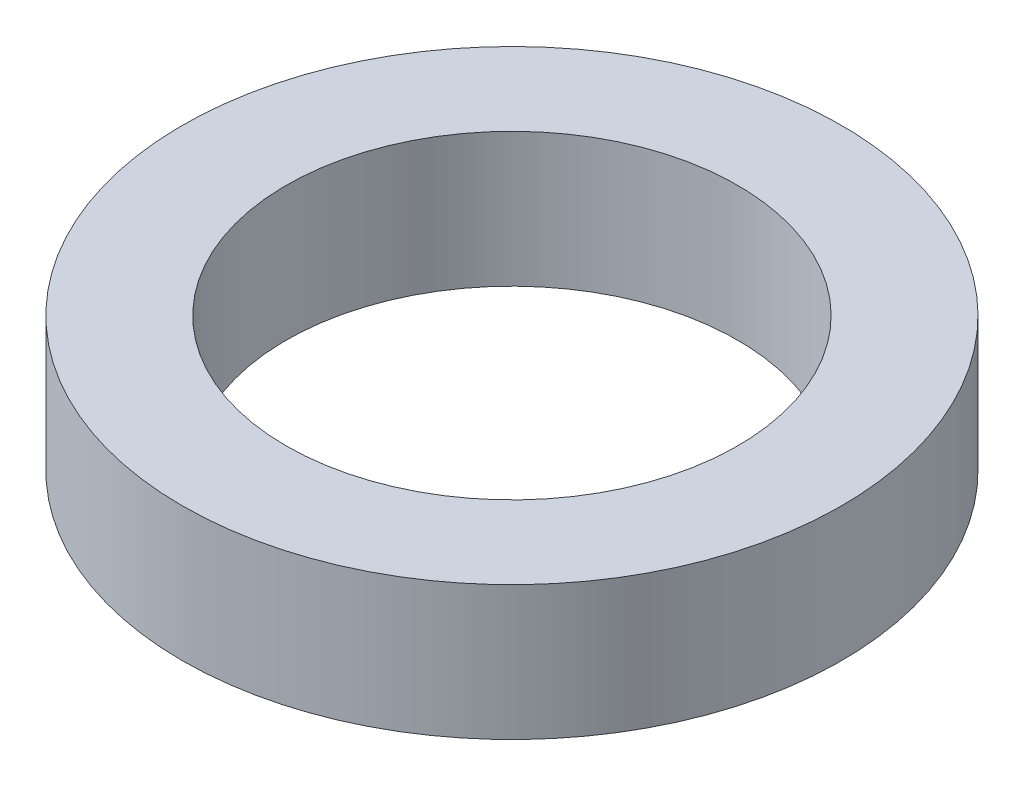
ISO-10303-21;
HEADER;
FILE_DESCRIPTION(('STEP AP214'),'2;1');
FILE_NAME('part.step','',(''),(''),'','','');
FILE_SCHEMA(('AUTOMOTIVE_DESIGN { 1 0 10303 214 1 1 1 1 }'));
ENDSEC;
DATA;
#1=APPLICATION_CONTEXT('core data for automotive mechanical design processes');
#2=APPLICATION_PROTOCOL_DEFINITION('international standard','automotive_design',2000,#1);
#3=PRODUCT_CONTEXT('',#1,'mechanical');
#4=PRODUCT('Part','Part','',(#3));
#5=PRODUCT_RELATED_PRODUCT_CATEGORY('part','',(#4));
#6=PRODUCT_DEFINITION_FORMATION('','',#4);
#7=PRODUCT_DEFINITION_CONTEXT('part definition',#1,'design');
#8=PRODUCT_DEFINITION('design','',#6,#7);
#9=PRODUCT_DEFINITION_SHAPE('','',#8);
#10=(LENGTH_UNIT() NAMED_UNIT(*) SI_UNIT(.MILLI.,.METRE.));
#11=(NAMED_UNIT(*) PLANE_ANGLE_UNIT() SI_UNIT($,.RADIAN.));
#12=(NAMED_UNIT(*) SI_UNIT($,.STERADIAN.) SOLID_ANGLE_UNIT());
#13=UNCERTAINTY_MEASURE_WITH_UNIT(LENGTH_MEASURE(1.E-05),#10,'distance_accuracy_value','');
#14=(GEOMETRIC_REPRESENTATION_CONTEXT(3) GLOBAL_UNCERTAINTY_ASSIGNED_CONTEXT((#13)) GLOBAL_UNIT_ASSIGNED_CONTEXT((#10,
#11,#12)) REPRESENTATION_CONTEXT('',''));
#15=CARTESIAN_POINT('',(0.,0.,0.));
#16=DIRECTION('',(0.,0.,1.));
#17=DIRECTION('',(1.,0.,0.));
#18=AXIS2_PLACEMENT_3D('',#15,#16,#17);
#19=CARTESIAN_POINT('',(0.,2.3622,0.));
#20=DIRECTION('',(0.,1.,0.));
#21=DIRECTION('',(0.,0.,1.));
#22=AXIS2_PLACEMENT_3D('',#19,#20,#21);
#23=PLANE('',#22);
#24=CARTESIAN_POINT('',(0.,2.3622,0.));
#25=DIRECTION('',(0.,1.,0.));
#26=DIRECTION('',(0.,0.,1.));
#27=AXIS2_PLACEMENT_3D('',#24,#25,#26);
#28=CIRCLE('',#27,5.8039);
#29=CARTESIAN_POINT('',(0.,2.3622,5.8039));
#30=VERTEX_POINT('',#29);
#31=EDGE_CURVE('E10',#30,#30,#28,.T.);
#32=ORIENTED_EDGE('',*,*,#31,.T.);
#33=EDGE_LOOP('',(#32));
#34=FACE_BOUND('',#33,.T.);
#35=CARTESIAN_POINT('',(0.,2.3622,0.));
#36=DIRECTION('',(0.,1.,0.));
#37=DIRECTION('',(0.,0.,1.));
#38=AXIS2_PLACEMENT_3D('',#35,#36,#37);
#39=CIRCLE('',#38,3.9751);
#40=CARTESIAN_POINT('',(0.,2.3622,3.9751));
#41=VERTEX_POINT('',#40);
#42=EDGE_CURVE('E41',#41,#41,#39,.T.);
#43=ORIENTED_EDGE('',*,*,#42,.F.);
#44=EDGE_LOOP('',(#43));
#45=FACE_BOUND('',#44,.T.);
#46=ADVANCED_FACE('F30',(#34,#45),#23,.T.);
#47=CARTESIAN_POINT('',(0.,0.,0.));
#48=DIRECTION('',(0.,1.,0.));
#49=DIRECTION('',(0.,0.,1.));
#50=AXIS2_PLACEMENT_3D('',#47,#48,#49);
#51=PLANE('',#50);
#52=CARTESIAN_POINT('',(0.,0.,0.));
#53=DIRECTION('',(0.,1.,0.));
#54=DIRECTION('',(0.,0.,1.));
#55=AXIS2_PLACEMENT_3D('',#52,#53,#54);
#56=CIRCLE('',#55,5.8039);
#57=CARTESIAN_POINT('',(0.,0.,5.8039));
#58=VERTEX_POINT('',#57);
#59=EDGE_CURVE('E34',#58,#58,#56,.T.);
#60=ORIENTED_EDGE('',*,*,#59,.F.);
#61=EDGE_LOOP('',(#60));
#62=FACE_BOUND('',#61,.T.);
#63=CARTESIAN_POINT('',(0.,0.,0.));
#64=DIRECTION('',(0.,1.,0.));
#65=DIRECTION('',(0.,0.,1.));
#66=AXIS2_PLACEMENT_3D('',#63,#64,#65);
#67=CIRCLE('',#66,3.9751);
#68=CARTESIAN_POINT('',(0.,0.,3.9751));
#69=VERTEX_POINT('',#68);
#70=EDGE_CURVE('E43',#69,#69,#67,.T.);
#71=ORIENTED_EDGE('',*,*,#70,.T.);
#72=EDGE_LOOP('',(#71));
#73=FACE_BOUND('',#72,.T.);
#74=ADVANCED_FACE('F53',(#62,#73),#51,.F.);
#75=CARTESIAN_POINT('',(0.,2.3622,0.));
#76=DIRECTION('',(0.,-1.,0.));
#77=DIRECTION('',(0.,0.,-1.));
#78=AXIS2_PLACEMENT_3D('',#75,#76,#77);
#79=CYLINDRICAL_SURFACE('',#78,5.8039);
#80=ORIENTED_EDGE('',*,*,#31,.F.);
#81=EDGE_LOOP('',(#80));
#82=FACE_BOUND('',#81,.T.);
#83=ORIENTED_EDGE('',*,*,#59,.T.);
#84=EDGE_LOOP('',(#83));
#85=FACE_BOUND('',#84,.T.);
#86=ADVANCED_FACE('F32',(#82,#85),#79,.T.);
#87=CARTESIAN_POINT('',(0.,2.3622,0.));
#88=DIRECTION('',(0.,-1.,0.));
#89=DIRECTION('',(0.,0.,-1.));
#90=AXIS2_PLACEMENT_3D('',#87,#88,#89);
#91=CYLINDRICAL_SURFACE('',#90,3.9751);
#92=ORIENTED_EDGE('',*,*,#42,.T.);
#93=EDGE_LOOP('',(#92));
#94=FACE_BOUND('',#93,.T.);
#95=ORIENTED_EDGE('',*,*,#70,.F.);
#96=EDGE_LOOP('',(#95));
#97=FACE_BOUND('',#96,.T.);
#98=ADVANCED_FACE('F49',(#94,#97),#91,.F.);
#99=CLOSED_SHELL('',(#46,#74,#86,#98));
#100=MANIFOLD_SOLID_BREP('B2',#99);
#101=ADVANCED_BREP_SHAPE_REPRESENTATION('',(#18,#100),#14);
#102=SHAPE_DEFINITION_REPRESENTATION(#9,#101);
ENDSEC;
END-ISO-10303-21;
